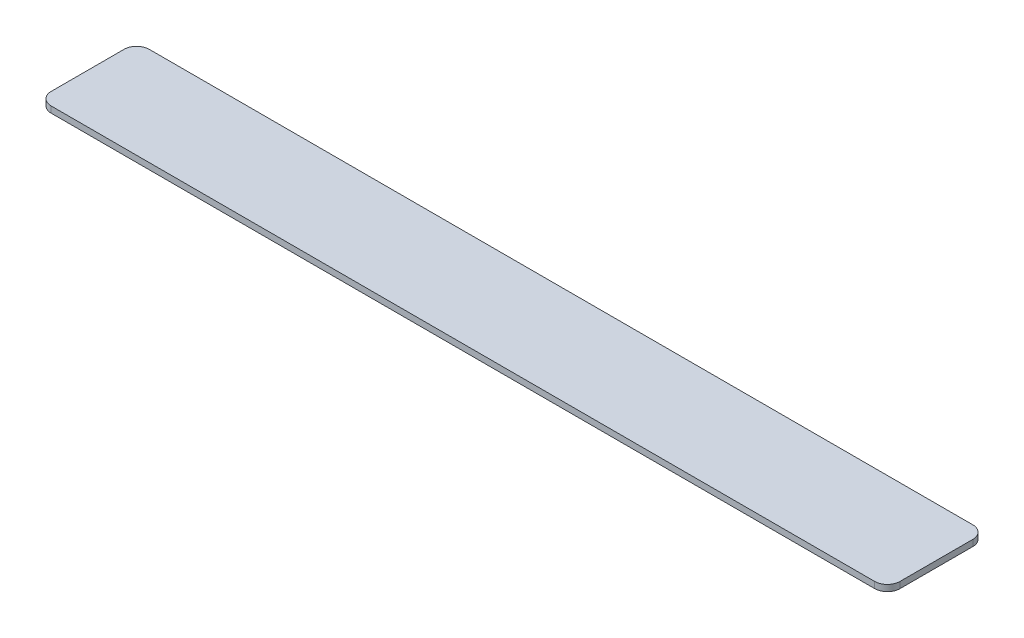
from build123d import *

# Parameters (mm, degrees)
SKETCH1_W      = 429.895
SKETCH1_H      = 49.6824
EXTRUDE1_DEPTH = 3.175
FILLET1_R      = 6.4


with BuildPart() as part:
    # Sketch1 → Extrude1 (new body)
    with BuildSketch(Plane(origin=(0, 0, 0), x_dir=(1, 0, 0), z_dir=(0, 1, 0))):
        Rectangle(SKETCH1_W, SKETCH1_H)
    extrude(amount=EXTRUDE1_DEPTH)

    # Fillet1
    fillet1_edges = [part.edges().sort_by_distance(p)[0] for p in [
        (-214.9475, 1.5875, -24.8412),
        (214.9475, 1.5875, -24.8412),
        (214.9475, 1.5875, 24.8412),
        (-214.9475, 1.5875, 24.8412),
    ]]
    fillet(fillet1_edges, radius=FILLET1_R)


solid = part.part
